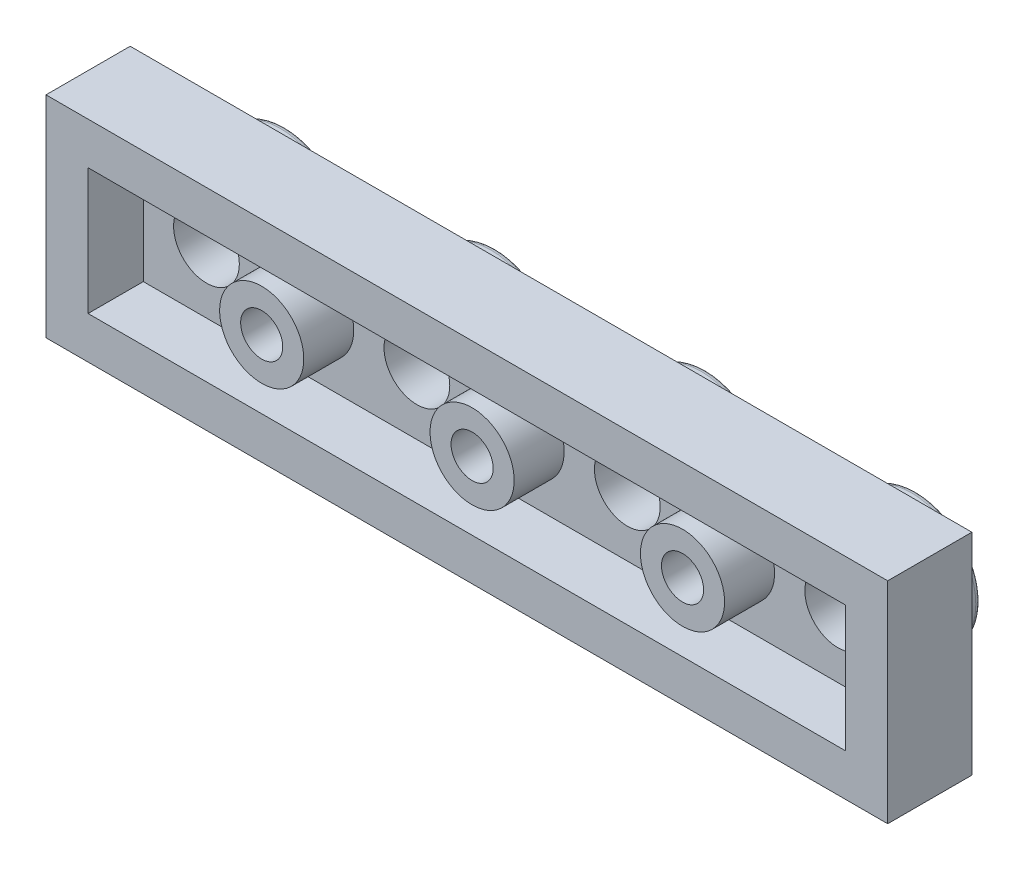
from build123d import *

# Parameters (mm, degrees)
SKIZZE1_W                         = 32
SKIZZE1_H                         = 8
LINEAR_AUSTRAGEN1_DEPTH           = 3.2
SKIZZE2_W                         = 28.8
SKIZZE2_H                         = 4.8
SCHNITT_LINEAR_AUSTRAGEN1_DEPTH   = 2.1
SKIZZE3_R                         = 1.6
SKIZZE3_R_2                       = 0.8
LINEAR_AUSTRAGEN2_DEPTH           = 1.9
SKIZZE4_R                         = 2.45
LINEAR_AUSTRAGEN3_DEPTH           = 1.9
VERRUNDUNG1_R                     = 0.2
SKIZZE9_R                         = 1.25
SCHNITT_LINEAR_AUSTRAGEN2_DEPTH   = 1.8
LINEARES_MUSTER2_COUNT            = 3
LINEARES_MUSTER2_PITCH            = 8
LINEARES_MUSTER3_COUNT            = 4
LINEARES_MUSTER3_PITCH            = 8
VERRUNDUNG1_OF_LINEARES_MUSTER3_R = 0.2


with BuildPart() as part:
    # Skizze1 → Linear austragen1 (new body)
    with BuildSketch(Plane.XY):
        with Locations((-16, -4)):
            Rectangle(SKIZZE1_W, SKIZZE1_H)
    extrude(amount=LINEAR_AUSTRAGEN1_DEPTH)

    # Skizze2 → Schnitt-Linear austragen1 (cut)
    with BuildSketch(Plane.XY.offset(3.2)):
        with Locations((-16, -4)):
            Rectangle(SKIZZE2_W, SKIZZE2_H)
    extrude(amount=-SCHNITT_LINEAR_AUSTRAGEN1_DEPTH, mode=Mode.SUBTRACT)

    # Skizze3 → Linear austragen2 (add)
    with BuildSketch(Plane.XY.offset(1.1)):
        with Locations(Location((-8, -4, 0), (0, 0, 180))):
            Circle(SKIZZE3_R)
        with Locations(Location((-8, -4, 0), (0, 0, 180))):
            Circle(SKIZZE3_R_2, mode=Mode.SUBTRACT)
    linear_austragen2 = extrude(amount=LINEAR_AUSTRAGEN2_DEPTH)

    # Skizze4 → Linear austragen3 (add)
    with BuildSketch(Plane(origin=(0, 0, 0), x_dir=(-1, 0, 0), z_dir=(0, 0, -1))):
        with Locations(Location((4, -4, 0), (0, 0, 180))):
            Circle(SKIZZE4_R)
    linear_austragen3 = extrude(amount=LINEAR_AUSTRAGEN3_DEPTH)

    # Verrundung1
    verrundung1_edges = [part.edges().sort_by_distance(p)[0] for p in [
        (-6.45, -4, -1.9),
    ]]
    fillet(verrundung1_edges, radius=VERRUNDUNG1_R)

    # Skizze9 → Schnitt-Linear austragen2 (cut)
    with BuildSketch(Plane.XY.offset(1.1)):
        with Locations((-4, -4)):
            Circle(SKIZZE9_R)
    schnitt_linear_austragen2 = extrude(amount=-SCHNITT_LINEAR_AUSTRAGEN2_DEPTH, mode=Mode.SUBTRACT)

    # Lineares Muster2: Linear austragen2 ×3
    with Locations(*[(-i * LINEARES_MUSTER2_PITCH, 0, 0) for i in range(1, LINEARES_MUSTER2_COUNT)]):
        add(linear_austragen2)

    # Lineares Muster3: Linear austragen3, Schnitt-Linear austragen2 ×4
    with Locations(*[(-i * LINEARES_MUSTER3_PITCH, 0, 0) for i in range(1, LINEARES_MUSTER3_COUNT)]):
        add(linear_austragen3)
        add(schnitt_linear_austragen2, mode=Mode.SUBTRACT)

    # Verrundung1 of Lineares Muster3
    verrundung1_of_lineares_muster3_edges = [part.edges().sort_by_distance(p)[0] for p in [
        (-14.45, -4, -1.9),
        (-22.45, -4, -1.9),
        (-30.45, -4, -1.9),
    ]]
    fillet(verrundung1_of_lineares_muster3_edges, radius=VERRUNDUNG1_OF_LINEARES_MUSTER3_R)


solid = part.part
